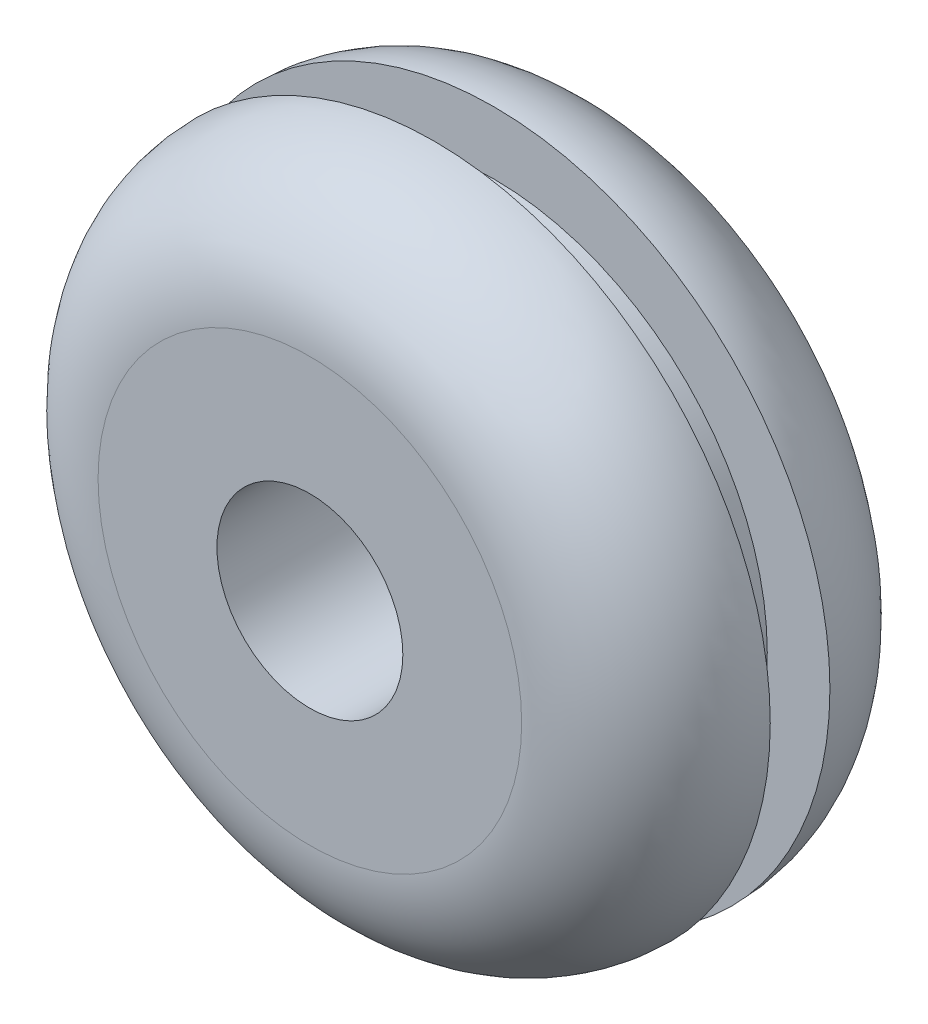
ISO-10303-21;
HEADER;
FILE_DESCRIPTION(('STEP AP214'),'2;1');
FILE_NAME('part.step','',(''),(''),'','','');
FILE_SCHEMA(('AUTOMOTIVE_DESIGN { 1 0 10303 214 1 1 1 1 }'));
ENDSEC;
DATA;
#1=APPLICATION_CONTEXT('core data for automotive mechanical design processes');
#2=APPLICATION_PROTOCOL_DEFINITION('international standard','automotive_design',2000,#1);
#3=PRODUCT_CONTEXT('',#1,'mechanical');
#4=PRODUCT('Part','Part','',(#3));
#5=PRODUCT_RELATED_PRODUCT_CATEGORY('part','',(#4));
#6=PRODUCT_DEFINITION_FORMATION('','',#4);
#7=PRODUCT_DEFINITION_CONTEXT('part definition',#1,'design');
#8=PRODUCT_DEFINITION('design','',#6,#7);
#9=PRODUCT_DEFINITION_SHAPE('','',#8);
#10=(LENGTH_UNIT() NAMED_UNIT(*) SI_UNIT(.MILLI.,.METRE.));
#11=(NAMED_UNIT(*) PLANE_ANGLE_UNIT() SI_UNIT($,.RADIAN.));
#12=(NAMED_UNIT(*) SI_UNIT($,.STERADIAN.) SOLID_ANGLE_UNIT());
#13=UNCERTAINTY_MEASURE_WITH_UNIT(LENGTH_MEASURE(1.E-05),#10,'distance_accuracy_value','');
#14=(GEOMETRIC_REPRESENTATION_CONTEXT(3) GLOBAL_UNCERTAINTY_ASSIGNED_CONTEXT((#13)) GLOBAL_UNIT_ASSIGNED_CONTEXT((#10,
#11,#12)) REPRESENTATION_CONTEXT('',''));
#15=CARTESIAN_POINT('',(0.,0.,0.));
#16=DIRECTION('',(0.,0.,1.));
#17=DIRECTION('',(1.,0.,0.));
#18=AXIS2_PLACEMENT_3D('',#15,#16,#17);
#19=CARTESIAN_POINT('',(0.,0.,0.762));
#20=DIRECTION('',(0.,0.,-1.));
#21=DIRECTION('',(-1.,0.,0.));
#22=AXIS2_PLACEMENT_3D('',#19,#20,#21);
#23=CYLINDRICAL_SURFACE('',#22,6.985);
#24=CARTESIAN_POINT('',(0.,0.,0.762));
#25=DIRECTION('',(0.,0.,1.));
#26=DIRECTION('',(1.,0.,0.));
#27=AXIS2_PLACEMENT_3D('',#24,#25,#26);
#28=CIRCLE('',#27,6.985);
#29=CARTESIAN_POINT('',(-6.985,0.,0.762));
#30=VERTEX_POINT('',#29);
#31=EDGE_CURVE('E36',#30,#30,#28,.T.);
#32=CARTESIAN_POINT('',(0.,0.,-0.762));
#33=DIRECTION('',(0.,0.,-1.));
#34=DIRECTION('',(-1.,0.,0.));
#35=AXIS2_PLACEMENT_3D('',#32,#33,#34);
#36=CIRCLE('',#35,6.985);
#37=CARTESIAN_POINT('',(-6.985,0.,-0.762));
#38=VERTEX_POINT('',#37);
#39=EDGE_CURVE('E45',#38,#38,#36,.T.);
#40=CARTESIAN_POINT('',(-6.985,0.,0.762));
#41=CARTESIAN_POINT('',(-6.985,0.,0.746125));
#42=CARTESIAN_POINT('',(-6.985,0.,0.73025));
#43=CARTESIAN_POINT('',(-6.985,0.,0.6985));
#44=CARTESIAN_POINT('',(-6.985,0.,0.682625));
#45=CARTESIAN_POINT('',(-6.985,0.,0.650875));
#46=CARTESIAN_POINT('',(-6.985,0.,0.635));
#47=CARTESIAN_POINT('',(-6.985,0.,0.60325));
#48=CARTESIAN_POINT('',(-6.985,0.,0.587375));
#49=CARTESIAN_POINT('',(-6.985,0.,0.555625));
#50=CARTESIAN_POINT('',(-6.985,0.,0.53975));
#51=CARTESIAN_POINT('',(-6.985,0.,0.508));
#52=CARTESIAN_POINT('',(-6.985,0.,0.492125));
#53=CARTESIAN_POINT('',(-6.985,0.,0.460375));
#54=CARTESIAN_POINT('',(-6.985,0.,0.4445));
#55=CARTESIAN_POINT('',(-6.985,0.,0.41275));
#56=CARTESIAN_POINT('',(-6.985,0.,0.396875));
#57=CARTESIAN_POINT('',(-6.985,0.,0.365125));
#58=CARTESIAN_POINT('',(-6.985,0.,0.34925));
#59=CARTESIAN_POINT('',(-6.985,0.,0.3175));
#60=CARTESIAN_POINT('',(-6.985,0.,0.301625));
#61=CARTESIAN_POINT('',(-6.985,0.,0.269875));
#62=CARTESIAN_POINT('',(-6.985,0.,0.254));
#63=CARTESIAN_POINT('',(-6.985,0.,0.22225));
#64=CARTESIAN_POINT('',(-6.985,0.,0.206375));
#65=CARTESIAN_POINT('',(-6.985,0.,0.174625));
#66=CARTESIAN_POINT('',(-6.985,0.,0.15875));
#67=CARTESIAN_POINT('',(-6.985,0.,0.127));
#68=CARTESIAN_POINT('',(-6.985,0.,0.111125));
#69=CARTESIAN_POINT('',(-6.985,0.,0.0793749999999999));
#70=CARTESIAN_POINT('',(-6.985,0.,0.0634999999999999));
#71=CARTESIAN_POINT('',(-6.985,0.,0.0317499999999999));
#72=CARTESIAN_POINT('',(-6.985,0.,0.0158749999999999));
#73=CARTESIAN_POINT('',(-6.985,0.,-0.0158750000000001));
#74=CARTESIAN_POINT('',(-6.985,0.,-0.0317500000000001));
#75=CARTESIAN_POINT('',(-6.985,0.,-0.0635000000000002));
#76=CARTESIAN_POINT('',(-6.985,0.,-0.0793750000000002));
#77=CARTESIAN_POINT('',(-6.985,0.,-0.111125));
#78=CARTESIAN_POINT('',(-6.985,0.,-0.127));
#79=CARTESIAN_POINT('',(-6.985,0.,-0.15875));
#80=CARTESIAN_POINT('',(-6.985,0.,-0.174625));
#81=CARTESIAN_POINT('',(-6.985,0.,-0.206375));
#82=CARTESIAN_POINT('',(-6.985,0.,-0.22225));
#83=CARTESIAN_POINT('',(-6.985,0.,-0.254));
#84=CARTESIAN_POINT('',(-6.985,0.,-0.269875));
#85=CARTESIAN_POINT('',(-6.985,0.,-0.301625));
#86=CARTESIAN_POINT('',(-6.985,0.,-0.3175));
#87=CARTESIAN_POINT('',(-6.985,0.,-0.34925));
#88=CARTESIAN_POINT('',(-6.985,0.,-0.365125));
#89=CARTESIAN_POINT('',(-6.985,0.,-0.396875));
#90=CARTESIAN_POINT('',(-6.985,0.,-0.41275));
#91=CARTESIAN_POINT('',(-6.985,0.,-0.4445));
#92=CARTESIAN_POINT('',(-6.985,0.,-0.460375));
#93=CARTESIAN_POINT('',(-6.985,0.,-0.492125));
#94=CARTESIAN_POINT('',(-6.985,0.,-0.508));
#95=CARTESIAN_POINT('',(-6.985,0.,-0.53975));
#96=CARTESIAN_POINT('',(-6.985,0.,-0.555625));
#97=CARTESIAN_POINT('',(-6.985,0.,-0.587375));
#98=CARTESIAN_POINT('',(-6.985,0.,-0.60325));
#99=CARTESIAN_POINT('',(-6.985,0.,-0.635));
#100=CARTESIAN_POINT('',(-6.985,0.,-0.650875));
#101=CARTESIAN_POINT('',(-6.985,0.,-0.682625));
#102=CARTESIAN_POINT('',(-6.985,0.,-0.6985));
#103=CARTESIAN_POINT('',(-6.985,0.,-0.73025));
#104=CARTESIAN_POINT('',(-6.985,0.,-0.746125));
#105=CARTESIAN_POINT('',(-6.985,0.,-0.762));
#106=B_SPLINE_CURVE_WITH_KNOTS('',3,(#40,#41,#42,#43,#44,#45,#46,#47,#48,#49,#50,#51,#52,#53,
#54,#55,#56,#57,#58,#59,#60,#61,#62,#63,#64,#65,#66,#67,#68,#69,#70,#71,#72,#73,#74,#75,#76,#77,
#78,#79,#80,#81,#82,#83,#84,#85,#86,#87,#88,#89,#90,#91,#92,#93,#94,#95,#96,#97,#98,#99,#100,
#101,#102,#103,#104,#105),.UNSPECIFIED.,.F.,.F.,(4,2,2,2,2,2,2,2,2,2,2,2,2,2,2,2,2,2,2,2,2,2,2,
2,2,2,2,2,2,2,2,2,4),(0.,0.0476249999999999,0.09525,0.142875,0.1905,0.238125,0.28575,0.333375,
0.381,0.428625,0.47625,0.523875,0.5715,0.619125,0.66675,0.714375,0.762,0.809625,0.85725,
0.904875,0.9525,1.000125,1.04775,1.095375,1.143,1.190625,1.23825,1.285875,1.3335,1.381125,
1.42875,1.476375,1.524),.UNSPECIFIED.);
#107=EDGE_CURVE('BSEAM26',#30,#38,#106,.T.);
#108=ORIENTED_EDGE('',*,*,#31,.F.);
#109=ORIENTED_EDGE('',*,*,#39,.F.);
#110=ORIENTED_EDGE('',*,*,#107,.T.);
#111=ORIENTED_EDGE('',*,*,#107,.F.);
#112=EDGE_LOOP('',(#108,#110,#109,#111));
#113=FACE_BOUND('',#112,.T.);
#114=ADVANCED_FACE('F26',(#113),#23,.T.);
#115=CARTESIAN_POINT('',(0.,0.,0.762));
#116=DIRECTION('',(0.,0.,1.));
#117=DIRECTION('',(1.,0.,0.));
#118=AXIS2_PLACEMENT_3D('',#115,#116,#117);
#119=PLANE('',#118);
#120=CARTESIAN_POINT('',(0.,0.,0.762));
#121=DIRECTION('',(0.,0.,1.));
#122=DIRECTION('',(1.,0.,0.));
#123=AXIS2_PLACEMENT_3D('',#120,#121,#122);
#124=CIRCLE('',#123,8.5852);
#125=CARTESIAN_POINT('',(8.5852,0.,0.762));
#126=VERTEX_POINT('',#125);
#127=EDGE_CURVE('E40',#126,#126,#124,.T.);
#128=ORIENTED_EDGE('',*,*,#127,.F.);
#129=EDGE_LOOP('',(#128));
#130=FACE_BOUND('',#129,.T.);
#131=ORIENTED_EDGE('',*,*,#31,.T.);
#132=EDGE_LOOP('',(#131));
#133=FACE_BOUND('',#132,.T.);
#134=ADVANCED_FACE('F63',(#130,#133),#119,.F.);
#135=CARTESIAN_POINT('',(0.,0.,3.937));
#136=DIRECTION('',(0.,0.,1.));
#137=DIRECTION('',(1.,0.,0.));
#138=AXIS2_PLACEMENT_3D('',#135,#136,#137);
#139=PLANE('',#138);
#140=CARTESIAN_POINT('',(0.,0.,3.937));
#141=DIRECTION('',(0.,0.,1.));
#142=DIRECTION('',(1.,0.,0.));
#143=AXIS2_PLACEMENT_3D('',#140,#141,#142);
#144=CIRCLE('',#143,2.3749);
#145=CARTESIAN_POINT('',(2.3749,0.,3.937));
#146=VERTEX_POINT('',#145);
#147=EDGE_CURVE('E54',#146,#146,#144,.T.);
#148=ORIENTED_EDGE('',*,*,#147,.F.);
#149=EDGE_LOOP('',(#148));
#150=FACE_BOUND('',#149,.T.);
#151=CARTESIAN_POINT('',(0.,0.,3.937));
#152=DIRECTION('',(0.,0.,1.));
#153=DIRECTION('',(1.,0.,0.));
#154=AXIS2_PLACEMENT_3D('',#151,#152,#153);
#155=CIRCLE('',#154,5.4102);
#156=CARTESIAN_POINT('',(5.4102,0.,3.937));
#157=VERTEX_POINT('',#156);
#158=EDGE_CURVE('E32',#157,#157,#155,.T.);
#159=ORIENTED_EDGE('',*,*,#158,.T.);
#160=EDGE_LOOP('',(#159));
#161=FACE_BOUND('',#160,.T.);
#162=ADVANCED_FACE('F60',(#150,#161),#139,.T.);
#163=CARTESIAN_POINT('',(0.,0.,0.762));
#164=DIRECTION('',(0.,0.,1.));
#165=DIRECTION('',(1.,0.,0.));
#166=AXIS2_PLACEMENT_3D('',#163,#164,#165);
#167=TOROIDAL_SURFACE('',#166,5.4102,3.175);
#168=ORIENTED_EDGE('',*,*,#127,.T.);
#169=EDGE_LOOP('',(#168));
#170=FACE_BOUND('',#169,.T.);
#171=ORIENTED_EDGE('',*,*,#158,.F.);
#172=EDGE_LOOP('',(#171));
#173=FACE_BOUND('',#172,.T.);
#174=ADVANCED_FACE('F62',(#170,#173),#167,.T.);
#175=CARTESIAN_POINT('',(0.,0.,-0.762));
#176=DIRECTION('',(0.,0.,-1.));
#177=DIRECTION('',(1.,0.,0.));
#178=AXIS2_PLACEMENT_3D('',#175,#176,#177);
#179=PLANE('',#178);
#180=CARTESIAN_POINT('',(0.,0.,-0.762));
#181=DIRECTION('',(0.,0.,1.));
#182=DIRECTION('',(1.,0.,0.));
#183=AXIS2_PLACEMENT_3D('',#180,#181,#182);
#184=CIRCLE('',#183,8.5852);
#185=CARTESIAN_POINT('',(8.5852,0.,-0.762));
#186=VERTEX_POINT('',#185);
#187=EDGE_CURVE('E48',#186,#186,#184,.T.);
#188=ORIENTED_EDGE('',*,*,#187,.T.);
#189=EDGE_LOOP('',(#188));
#190=FACE_BOUND('',#189,.T.);
#191=ORIENTED_EDGE('',*,*,#39,.T.);
#192=EDGE_LOOP('',(#191));
#193=FACE_BOUND('',#192,.T.);
#194=ADVANCED_FACE('F69',(#190,#193),#179,.F.);
#195=CARTESIAN_POINT('',(0.,0.,-3.937));
#196=DIRECTION('',(0.,0.,-1.));
#197=DIRECTION('',(1.,0.,0.));
#198=AXIS2_PLACEMENT_3D('',#195,#196,#197);
#199=PLANE('',#198);
#200=CARTESIAN_POINT('',(0.,0.,-3.937));
#201=DIRECTION('',(0.,0.,1.));
#202=DIRECTION('',(1.,0.,0.));
#203=AXIS2_PLACEMENT_3D('',#200,#201,#202);
#204=CIRCLE('',#203,2.3749);
#205=CARTESIAN_POINT('',(2.3749,0.,-3.937));
#206=VERTEX_POINT('',#205);
#207=EDGE_CURVE('E51',#206,#206,#204,.T.);
#208=ORIENTED_EDGE('',*,*,#207,.T.);
#209=EDGE_LOOP('',(#208));
#210=FACE_BOUND('',#209,.T.);
#211=CARTESIAN_POINT('',(0.,0.,-3.937));
#212=DIRECTION('',(0.,0.,-1.));
#213=DIRECTION('',(-1.,0.,0.));
#214=AXIS2_PLACEMENT_3D('',#211,#212,#213);
#215=CIRCLE('',#214,5.4102);
#216=CARTESIAN_POINT('',(-5.4102,0.,-3.937));
#217=VERTEX_POINT('',#216);
#218=EDGE_CURVE('E10',#217,#217,#215,.T.);
#219=ORIENTED_EDGE('',*,*,#218,.T.);
#220=EDGE_LOOP('',(#219));
#221=FACE_BOUND('',#220,.T.);
#222=ADVANCED_FACE('F84',(#210,#221),#199,.T.);
#223=CARTESIAN_POINT('',(0.,0.,-0.762));
#224=DIRECTION('',(0.,0.,-1.));
#225=DIRECTION('',(-1.,0.,0.));
#226=AXIS2_PLACEMENT_3D('',#223,#224,#225);
#227=TOROIDAL_SURFACE('',#226,5.4102,3.175);
#228=ORIENTED_EDGE('',*,*,#218,.F.);
#229=EDGE_LOOP('',(#228));
#230=FACE_BOUND('',#229,.T.);
#231=ORIENTED_EDGE('',*,*,#187,.F.);
#232=EDGE_LOOP('',(#231));
#233=FACE_BOUND('',#232,.T.);
#234=ADVANCED_FACE('F89',(#230,#233),#227,.T.);
#235=CARTESIAN_POINT('',(0.,0.,-3.937));
#236=DIRECTION('',(0.,0.,1.));
#237=DIRECTION('',(1.,0.,0.));
#238=AXIS2_PLACEMENT_3D('',#235,#236,#237);
#239=CYLINDRICAL_SURFACE('',#238,2.3749);
#240=ORIENTED_EDGE('',*,*,#207,.F.);
#241=EDGE_LOOP('',(#240));
#242=FACE_BOUND('',#241,.T.);
#243=ORIENTED_EDGE('',*,*,#147,.T.);
#244=EDGE_LOOP('',(#243));
#245=FACE_BOUND('',#244,.T.);
#246=ADVANCED_FACE('F58',(#242,#245),#239,.F.);
#247=CLOSED_SHELL('',(#114,#134,#162,#174,#194,#222,#234,#246));
#248=MANIFOLD_SOLID_BREP('B2',#247);
#249=ADVANCED_BREP_SHAPE_REPRESENTATION('',(#18,#248),#14);
#250=SHAPE_DEFINITION_REPRESENTATION(#9,#249);
ENDSEC;
END-ISO-10303-21;
